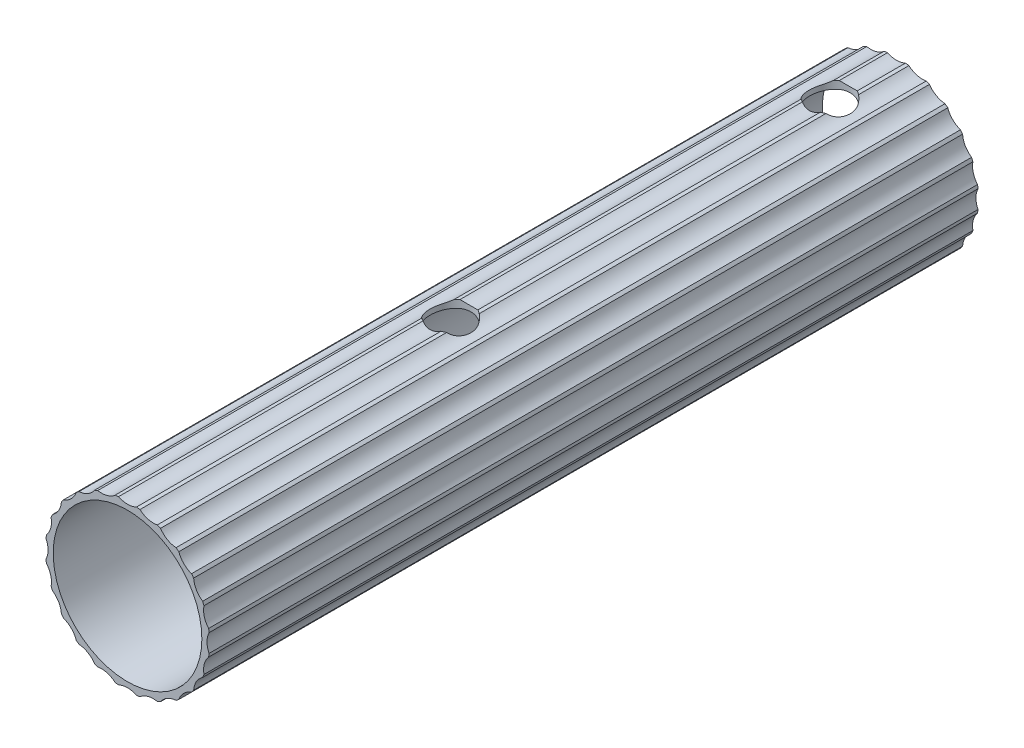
from build123d import *

# Parameters (mm, degrees)
ESQUISSE1_R                  = 16
ESQUISSE1_R_2                = 14.5
BOSS_EXTRU_1_DEPTH           = 150
ESQUISSE2_R                  = 4
ENL_V_MAT_EXTRU_1_DEPTH      = 150
R_P_TITION_CIRCULAIRE1_COUNT = 24
ESQUISSE4_R                  = 4
ENL_V_MAT_EXTRU_2_DEPTH      = 17.5


with BuildPart() as part:
    # Esquisse1 → Boss.-Extru.1 (new body)
    with BuildSketch(Plane.XY):
        Circle(ESQUISSE1_R)
        Circle(ESQUISSE1_R_2, mode=Mode.SUBTRACT)
    extrude(amount=BOSS_EXTRU_1_DEPTH)

    # Esquisse2 → Enl_v. mat.-Extru.1 (cut)
    with BuildSketch(Plane(origin=(0, 0, 0), x_dir=(-1, 0, 0), z_dir=(0, 0, -1))):
        with Locations((-19.5, 0)):
            Circle(ESQUISSE2_R)
    enl_v_mat_extru_1 = extrude(amount=-ENL_V_MAT_EXTRU_1_DEPTH, mode=Mode.SUBTRACT)

    # R_p_tition circulaire1: Enl_v. mat.-Extru.1 ×24 about axis
    r_p_tition_circulaire1_axis = Axis((0, 0, 0), (0, 0, 1))
    for i in range(1, R_P_TITION_CIRCULAIRE1_COUNT):
        add(enl_v_mat_extru_1.rotate(r_p_tition_circulaire1_axis, i * 360 / R_P_TITION_CIRCULAIRE1_COUNT), mode=Mode.SUBTRACT)

    # Esquisse4 → Enl_v. mat.-Extru.2 (cut, symmetric)
    with BuildSketch(Plane(origin=(0, 0, 0), x_dir=(1, 0, 0), z_dir=(0, 1, 0))):
        with Locations(Location((0, -13, 0), (0, 0, 270))):
            Circle(ESQUISSE4_R)
        with Locations(Location((0, -87, 0), (0, 0, 270))):
            Circle(ESQUISSE4_R)
    extrude(amount=ENL_V_MAT_EXTRU_2_DEPTH, both=True, mode=Mode.SUBTRACT)


solid = part.part
